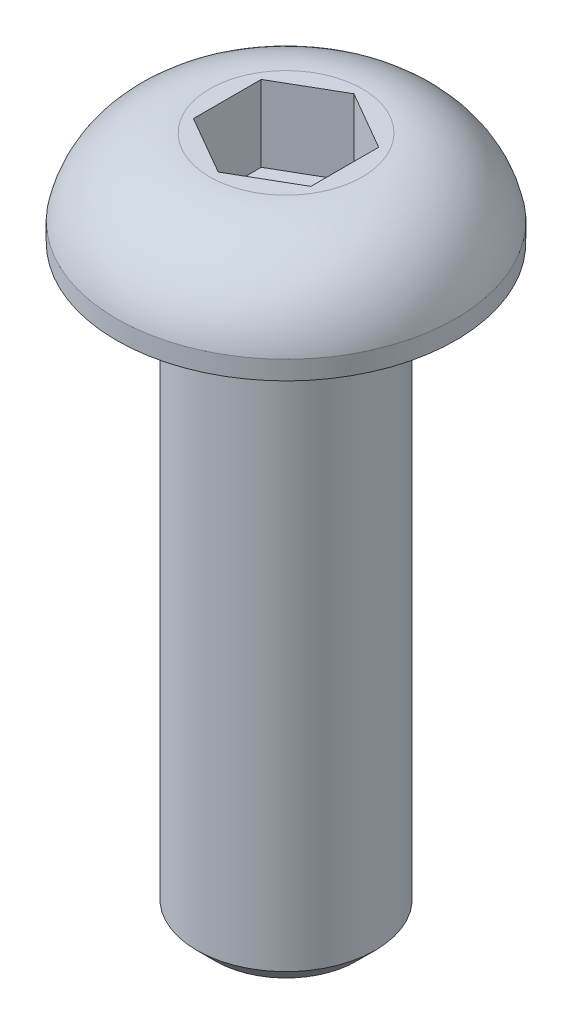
from build123d import *

# Parameters (mm, degrees)
HEXCUT_DEPTH       = 2.0574
SKETCH4_R          = 1.1811
CUT_EXTRUDE1_DEPTH = 20.547053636
CHAMFER1_SIZE      = 0.508


with BuildPart() as part:
    # Sketch1 → Screw (revolve)
    with BuildSketch(Plane.XY, mode=Mode.PRIVATE) as screw_sk:
        with BuildLine():
            Line((0, 0), (2.06375, 0))
            ThreePointArc((2.06375, 0), (3.690716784, -0.57963445), (4.5847, -2.0574))
            Line((4.5847, -2.0574), (4.5847, -2.5654))
            Line((4.5847, -2.5654), (2.413, -2.5654))
            Line((2.413, -2.5654), (2.413, -18.4404))
            Line((2.413, -18.4404), (0, -18.4404))
            Line((0, -18.4404), (0, 0))
        make_face()
    revolve(screw_sk.sketch.rotate(Axis((0, 25.4, 0), (0, -1, 0)), 90), axis=Axis((0, 25.4, 0), (0, -1, 0)))

    # Sketch2 → HexCut (cut)
    with BuildSketch(Plane(origin=(0, 0, 0), x_dir=(-1, 0, 0), z_dir=(0, 1, 0))):
        Polygon((-1.5875, -0.916543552), (-1.5875, 0.916543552), (0, 1.833087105), (1.5875, 0.916543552), (1.5875, -0.916543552), (0, -1.833087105), align=None)
    extrude(amount=-HEXCUT_DEPTH, mode=Mode.SUBTRACT)

    # Sketch4 → Cut-Extrude1 (cut, through all)
    with BuildSketch(Plane.XZ.offset(18.4404)):
        with Locations(Location((0, 0, 0), (0, 0, 270))):
            Circle(SKETCH4_R)
    extrude(amount=-CUT_EXTRUDE1_DEPTH, mode=Mode.SUBTRACT)

    # Chamfer1
    chamfer1_edges = [part.edges().sort_by_distance(p)[0] for p in [
        (0, -18.4404, -2.413),
    ]]
    chamfer(chamfer1_edges, length=CHAMFER1_SIZE)


solid = part.part
